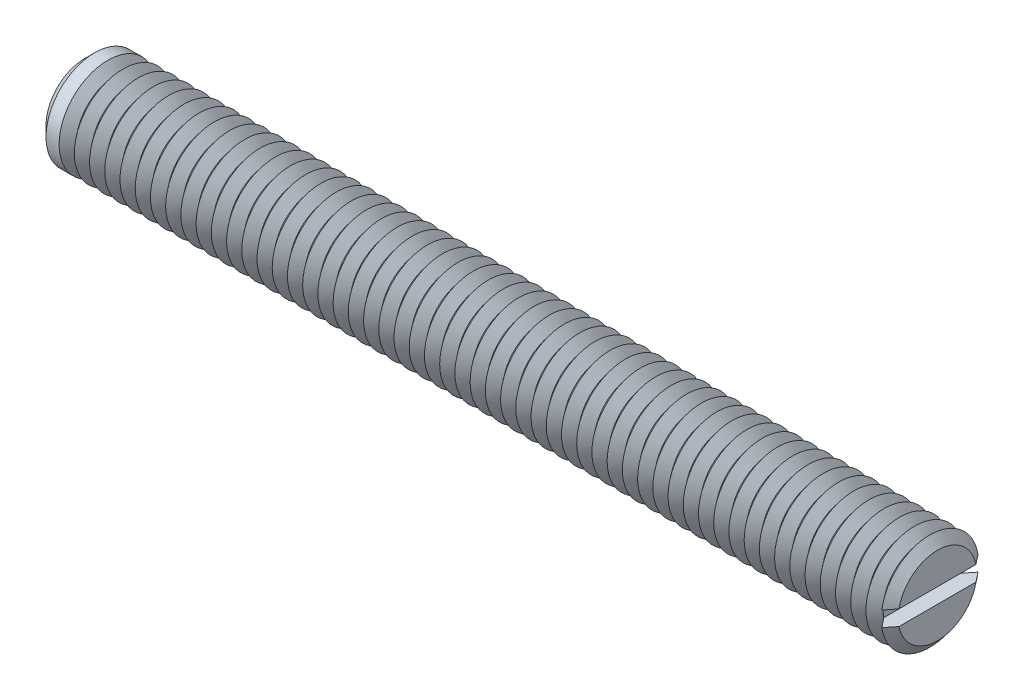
from build123d import *

# Parameters (mm, degrees)
SKETCH1_R       = 4
EXTRUDE1_DEPTH  = 35
SKETCH2_W       = 1.25
SKETCH2_H       = 1.25
EXTRUDE2_DEPTH  = 6
CHAMFER1_SIZE   = 0.8
LPATTERN1_COUNT = 55
LPATTERN1_PITCH = 1.25


with BuildPart() as part:
    # Sketch1 → Extrude1 (new, symmetric)
    with BuildSketch(Plane(origin=(0, 0, 0), x_dir=(0, 0, -1), z_dir=(1, 0, 0))):
        Circle(SKETCH1_R)
    extrude(amount=EXTRUDE1_DEPTH, both=True)

    # Sketch2 → Extrude2 (cut, symmetric)
    with BuildSketch(Plane.XY):
        with Locations((34.375, 0)):
            Rectangle(SKETCH2_W, SKETCH2_H)
    extrude(amount=EXTRUDE2_DEPTH, both=True, mode=Mode.SUBTRACT)

    # Chamfer1
    chamfer1_edges = [part.edges().sort_by_distance(p)[0] for p in [
        (-35, 0, 4),
    ]]
    chamfer(chamfer1_edges, length=CHAMFER1_SIZE)

    # Sketch3 → Cut-Revolve1 (revolve, cut)
    with BuildSketch(Plane.XY, mode=Mode.PRIVATE) as cut_revolve1_sk:
        Polygon((34.375, -4), (35.625, -4), (35, -3.21937525), align=None)
    cut_revolve1 = revolve(cut_revolve1_sk.sketch.rotate(Axis((0, 0, 0), (1, 0, 0)), 278.989299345), axis=Axis((0, 0, 0), (1, 0, 0)), mode=Mode.SUBTRACT)

    # LPattern1: Cut-Revolve1 ×55
    with Locations(*[(-i * LPATTERN1_PITCH, 0, 0) for i in range(1, LPATTERN1_COUNT)]):
        add(cut_revolve1, mode=Mode.SUBTRACT)


solid = part.part
